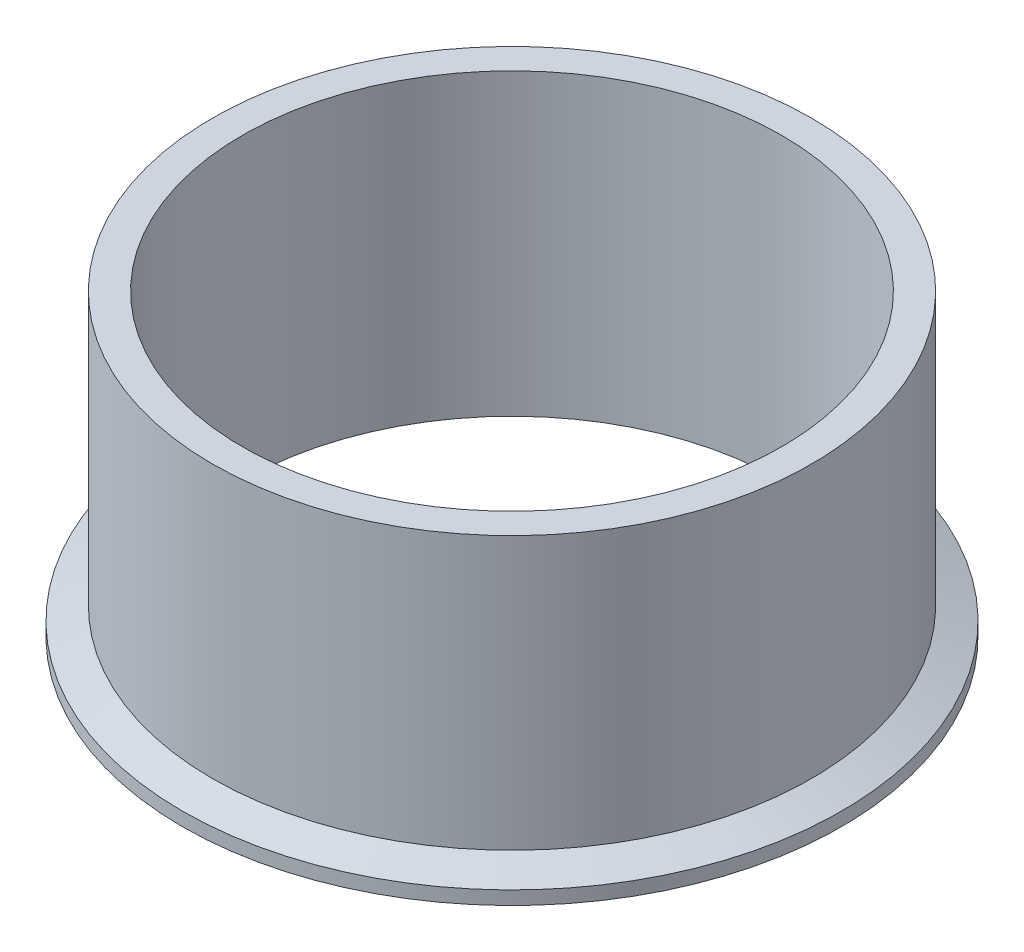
ISO-10303-21;
HEADER;
FILE_DESCRIPTION(('STEP AP214'),'2;1');
FILE_NAME('part.step','',(''),(''),'','','');
FILE_SCHEMA(('AUTOMOTIVE_DESIGN { 1 0 10303 214 1 1 1 1 }'));
ENDSEC;
DATA;
#1=APPLICATION_CONTEXT('core data for automotive mechanical design processes');
#2=APPLICATION_PROTOCOL_DEFINITION('international standard','automotive_design',2000,#1);
#3=PRODUCT_CONTEXT('',#1,'mechanical');
#4=PRODUCT('Part','Part','',(#3));
#5=PRODUCT_RELATED_PRODUCT_CATEGORY('part','',(#4));
#6=PRODUCT_DEFINITION_FORMATION('','',#4);
#7=PRODUCT_DEFINITION_CONTEXT('part definition',#1,'design');
#8=PRODUCT_DEFINITION('design','',#6,#7);
#9=PRODUCT_DEFINITION_SHAPE('','',#8);
#10=(LENGTH_UNIT() NAMED_UNIT(*) SI_UNIT(.MILLI.,.METRE.));
#11=(NAMED_UNIT(*) PLANE_ANGLE_UNIT() SI_UNIT($,.RADIAN.));
#12=(NAMED_UNIT(*) SI_UNIT($,.STERADIAN.) SOLID_ANGLE_UNIT());
#13=UNCERTAINTY_MEASURE_WITH_UNIT(LENGTH_MEASURE(1.E-05),#10,'distance_accuracy_value','');
#14=(GEOMETRIC_REPRESENTATION_CONTEXT(3) GLOBAL_UNCERTAINTY_ASSIGNED_CONTEXT((#13)) GLOBAL_UNIT_ASSIGNED_CONTEXT((#10,
#11,#12)) REPRESENTATION_CONTEXT('',''));
#15=CARTESIAN_POINT('',(0.,0.,0.));
#16=DIRECTION('',(0.,0.,1.));
#17=DIRECTION('',(1.,0.,0.));
#18=AXIS2_PLACEMENT_3D('',#15,#16,#17);
#19=CARTESIAN_POINT('',(0.,0.,0.));
#20=DIRECTION('',(0.,1.,0.));
#21=DIRECTION('',(0.,0.,1.));
#22=AXIS2_PLACEMENT_3D('',#19,#20,#21);
#23=PLANE('',#22);
#24=CARTESIAN_POINT('',(0.,0.,0.));
#25=DIRECTION('',(0.,-1.,0.));
#26=DIRECTION('',(0.,0.,-1.));
#27=AXIS2_PLACEMENT_3D('',#24,#25,#26);
#28=CIRCLE('',#27,56.7742603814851);
#29=CARTESIAN_POINT('',(0.,0.,-56.7742603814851));
#30=VERTEX_POINT('',#29);
#31=EDGE_CURVE('E10',#30,#30,#28,.T.);
#32=ORIENTED_EDGE('',*,*,#31,.F.);
#33=EDGE_LOOP('',(#32));
#34=FACE_BOUND('',#33,.T.);
#35=CARTESIAN_POINT('',(0.,0.,0.));
#36=DIRECTION('',(0.,-1.,0.));
#37=DIRECTION('',(0.,0.,-1.));
#38=AXIS2_PLACEMENT_3D('',#35,#36,#37);
#39=CIRCLE('',#38,59.4614);
#40=CARTESIAN_POINT('',(0.,0.,-59.4614));
#41=VERTEX_POINT('',#40);
#42=EDGE_CURVE('E73',#41,#41,#39,.T.);
#43=ORIENTED_EDGE('',*,*,#42,.T.);
#44=EDGE_LOOP('',(#43));
#45=FACE_BOUND('',#44,.T.);
#46=ADVANCED_FACE('F33',(#34,#45),#23,.F.);
#47=CARTESIAN_POINT('',(0.,0.762,0.));
#48=DIRECTION('',(0.,-1.,0.));
#49=DIRECTION('',(0.,0.,-1.));
#50=AXIS2_PLACEMENT_3D('',#47,#48,#49);
#51=TOROIDAL_SURFACE('',#50,56.7742603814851,0.762000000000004);
#52=CARTESIAN_POINT('',(0.,0.464262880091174,0.));
#53=DIRECTION('',(0.,-1.,0.));
#54=DIRECTION('',(0.,0.,-1.));
#55=AXIS2_PLACEMENT_3D('',#52,#53,#54);
#56=CIRCLE('',#55,56.0728356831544);
#57=CARTESIAN_POINT('',(0.,0.464262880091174,-56.0728356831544));
#58=VERTEX_POINT('',#57);
#59=EDGE_CURVE('E39',#58,#58,#56,.T.);
#60=ORIENTED_EDGE('',*,*,#59,.F.);
#61=EDGE_LOOP('',(#60));
#62=FACE_BOUND('',#61,.T.);
#63=ORIENTED_EDGE('',*,*,#31,.T.);
#64=EDGE_LOOP('',(#63));
#65=FACE_BOUND('',#64,.T.);
#66=ADVANCED_FACE('F114',(#62,#65),#51,.T.);
#67=CARTESIAN_POINT('',(0.,0.872854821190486,0.));
#68=DIRECTION('',(0.,-1.,0.));
#69=DIRECTION('',(0.,0.,-1.));
#70=AXIS2_PLACEMENT_3D('',#67,#68,#69);
#71=CONICAL_SURFACE('',#70,55.8993986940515,0.401425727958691);
#72=ORIENTED_EDGE('',*,*,#59,.T.);
#73=EDGE_LOOP('',(#72));
#74=FACE_BOUND('',#73,.T.);
#75=CARTESIAN_POINT('',(0.,0.872854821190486,0.));
#76=DIRECTION('',(0.,-1.,0.));
#77=DIRECTION('',(0.,0.,-1.));
#78=AXIS2_PLACEMENT_3D('',#75,#76,#77);
#79=CIRCLE('',#78,55.8993986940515);
#80=CARTESIAN_POINT('',(0.,0.872854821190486,-55.8993986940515));
#81=VERTEX_POINT('',#80);
#82=EDGE_CURVE('E43',#81,#81,#79,.T.);
#83=ORIENTED_EDGE('',*,*,#82,.F.);
#84=EDGE_LOOP('',(#83));
#85=FACE_BOUND('',#84,.T.);
#86=ADVANCED_FACE('F119',(#74,#85),#71,.F.);
#87=CARTESIAN_POINT('',(0.,0.4064,0.));
#88=DIRECTION('',(0.,-1.,0.));
#89=DIRECTION('',(0.,0.,-1.));
#90=AXIS2_PLACEMENT_3D('',#87,#88,#89);
#91=TOROIDAL_SURFACE('',#90,54.8005,1.1938);
#92=ORIENTED_EDGE('',*,*,#82,.T.);
#93=EDGE_LOOP('',(#92));
#94=FACE_BOUND('',#93,.T.);
#95=CARTESIAN_POINT('',(0.,0.872854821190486,0.));
#96=DIRECTION('',(0.,-1.,0.));
#97=DIRECTION('',(0.,0.,-1.));
#98=AXIS2_PLACEMENT_3D('',#95,#96,#97);
#99=CIRCLE('',#98,53.7016013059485);
#100=CARTESIAN_POINT('',(0.,0.872854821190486,-53.7016013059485));
#101=VERTEX_POINT('',#100);
#102=EDGE_CURVE('E47',#101,#101,#99,.T.);
#103=ORIENTED_EDGE('',*,*,#102,.F.);
#104=EDGE_LOOP('',(#103));
#105=FACE_BOUND('',#104,.T.);
#106=ADVANCED_FACE('F124',(#94,#105),#91,.F.);
#107=CARTESIAN_POINT('',(0.,0.872854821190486,0.));
#108=DIRECTION('',(0.,1.,0.));
#109=DIRECTION('',(0.,0.,1.));
#110=AXIS2_PLACEMENT_3D('',#107,#108,#109);
#111=CONICAL_SURFACE('',#110,53.7016013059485,0.401425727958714);
#112=CARTESIAN_POINT('',(0.,0.464262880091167,0.));
#113=DIRECTION('',(0.,-1.,0.));
#114=DIRECTION('',(0.,0.,-1.));
#115=AXIS2_PLACEMENT_3D('',#112,#113,#114);
#116=CIRCLE('',#115,53.5281643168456);
#117=CARTESIAN_POINT('',(0.,0.464262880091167,-53.5281643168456));
#118=VERTEX_POINT('',#117);
#119=EDGE_CURVE('E52',#118,#118,#116,.T.);
#120=ORIENTED_EDGE('',*,*,#119,.F.);
#121=EDGE_LOOP('',(#120));
#122=FACE_BOUND('',#121,.T.);
#123=ORIENTED_EDGE('',*,*,#102,.T.);
#124=EDGE_LOOP('',(#123));
#125=FACE_BOUND('',#124,.T.);
#126=ADVANCED_FACE('F129',(#122,#125),#111,.T.);
#127=CARTESIAN_POINT('',(0.,0.762,0.));
#128=DIRECTION('',(0.,-1.,0.));
#129=DIRECTION('',(0.,0.,-1.));
#130=AXIS2_PLACEMENT_3D('',#127,#128,#129);
#131=TOROIDAL_SURFACE('',#130,52.8267396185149,0.762000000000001);
#132=ORIENTED_EDGE('',*,*,#119,.T.);
#133=EDGE_LOOP('',(#132));
#134=FACE_BOUND('',#133,.T.);
#135=CARTESIAN_POINT('',(0.,0.,0.));
#136=DIRECTION('',(0.,-1.,0.));
#137=DIRECTION('',(0.,0.,-1.));
#138=AXIS2_PLACEMENT_3D('',#135,#136,#137);
#139=CIRCLE('',#138,52.8267396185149);
#140=CARTESIAN_POINT('',(0.,0.,-52.8267396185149));
#141=VERTEX_POINT('',#140);
#142=EDGE_CURVE('E55',#141,#141,#139,.T.);
#143=ORIENTED_EDGE('',*,*,#142,.F.);
#144=EDGE_LOOP('',(#143));
#145=FACE_BOUND('',#144,.T.);
#146=ADVANCED_FACE('F110',(#134,#145),#131,.T.);
#147=CARTESIAN_POINT('',(0.,0.,0.));
#148=DIRECTION('',(0.,1.,0.));
#149=DIRECTION('',(0.,0.,1.));
#150=AXIS2_PLACEMENT_3D('',#147,#148,#149);
#151=PLANE('',#150);
#152=CARTESIAN_POINT('',(0.,0.,0.));
#153=DIRECTION('',(0.,-1.,0.));
#154=DIRECTION('',(0.,0.,-1.));
#155=AXIS2_PLACEMENT_3D('',#152,#153,#154);
#156=CIRCLE('',#155,48.6664);
#157=CARTESIAN_POINT('',(0.,0.,-48.6664));
#158=VERTEX_POINT('',#157);
#159=EDGE_CURVE('E58',#158,#158,#156,.T.);
#160=ORIENTED_EDGE('',*,*,#159,.F.);
#161=EDGE_LOOP('',(#160));
#162=FACE_BOUND('',#161,.T.);
#163=ORIENTED_EDGE('',*,*,#142,.T.);
#164=EDGE_LOOP('',(#163));
#165=FACE_BOUND('',#164,.T.);
#166=ADVANCED_FACE('F104',(#162,#165),#151,.F.);
#167=CARTESIAN_POINT('',(0.,0.,0.));
#168=DIRECTION('',(0.,-1.,0.));
#169=DIRECTION('',(0.,0.,-1.));
#170=AXIS2_PLACEMENT_3D('',#167,#168,#169);
#171=CYLINDRICAL_SURFACE('',#170,48.6664);
#172=ORIENTED_EDGE('',*,*,#159,.T.);
#173=EDGE_LOOP('',(#172));
#174=FACE_BOUND('',#173,.T.);
#175=CARTESIAN_POINT('',(0.,53.975,0.));
#176=DIRECTION('',(0.,-1.,0.));
#177=DIRECTION('',(0.,0.,-1.));
#178=AXIS2_PLACEMENT_3D('',#175,#176,#177);
#179=CIRCLE('',#178,48.6664);
#180=CARTESIAN_POINT('',(0.,53.975,-48.6664));
#181=VERTEX_POINT('',#180);
#182=EDGE_CURVE('E61',#181,#181,#179,.T.);
#183=ORIENTED_EDGE('',*,*,#182,.F.);
#184=EDGE_LOOP('',(#183));
#185=FACE_BOUND('',#184,.T.);
#186=ADVANCED_FACE('F99',(#174,#185),#171,.F.);
#187=CARTESIAN_POINT('',(0.,53.975,0.));
#188=DIRECTION('',(0.,-1.,0.));
#189=DIRECTION('',(0.,0.,-1.));
#190=AXIS2_PLACEMENT_3D('',#187,#188,#189);
#191=PLANE('',#190);
#192=CARTESIAN_POINT('',(0.,53.975,0.));
#193=DIRECTION('',(0.,-1.,0.));
#194=DIRECTION('',(0.,0.,-1.));
#195=AXIS2_PLACEMENT_3D('',#192,#193,#194);
#196=CIRCLE('',#195,54.0512);
#197=CARTESIAN_POINT('',(0.,53.975,-54.0512));
#198=VERTEX_POINT('',#197);
#199=EDGE_CURVE('E64',#198,#198,#196,.T.);
#200=ORIENTED_EDGE('',*,*,#199,.F.);
#201=EDGE_LOOP('',(#200));
#202=FACE_BOUND('',#201,.T.);
#203=ORIENTED_EDGE('',*,*,#182,.T.);
#204=EDGE_LOOP('',(#203));
#205=FACE_BOUND('',#204,.T.);
#206=ADVANCED_FACE('F93',(#202,#205),#191,.F.);
#207=CARTESIAN_POINT('',(0.,0.,0.));
#208=DIRECTION('',(0.,-1.,0.));
#209=DIRECTION('',(0.,0.,-1.));
#210=AXIS2_PLACEMENT_3D('',#207,#208,#209);
#211=CYLINDRICAL_SURFACE('',#210,54.0512);
#212=CARTESIAN_POINT('',(0.,4.813951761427,0.));
#213=DIRECTION('',(0.,-1.,0.));
#214=DIRECTION('',(0.,0.,-1.));
#215=AXIS2_PLACEMENT_3D('',#212,#213,#214);
#216=CIRCLE('',#215,54.0512);
#217=CARTESIAN_POINT('',(0.,4.813951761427,-54.0512));
#218=VERTEX_POINT('',#217);
#219=EDGE_CURVE('E67',#218,#218,#216,.T.);
#220=ORIENTED_EDGE('',*,*,#219,.F.);
#221=EDGE_LOOP('',(#220));
#222=FACE_BOUND('',#221,.T.);
#223=ORIENTED_EDGE('',*,*,#199,.T.);
#224=EDGE_LOOP('',(#223));
#225=FACE_BOUND('',#224,.T.);
#226=ADVANCED_FACE('F87',(#222,#225),#211,.T.);
#227=CARTESIAN_POINT('',(0.,4.813951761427,0.));
#228=DIRECTION('',(0.,-1.,0.));
#229=DIRECTION('',(0.,0.,-1.));
#230=AXIS2_PLACEMENT_3D('',#227,#228,#229);
#231=CONICAL_SURFACE('',#230,54.0512,1.15705411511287);
#232=CARTESIAN_POINT('',(0.,2.43839999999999,0.));
#233=DIRECTION('',(0.,-1.,0.));
#234=DIRECTION('',(0.,0.,-1.));
#235=AXIS2_PLACEMENT_3D('',#232,#233,#234);
#236=CIRCLE('',#235,59.4614);
#237=CARTESIAN_POINT('',(0.,2.43839999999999,-59.4614));
#238=VERTEX_POINT('',#237);
#239=EDGE_CURVE('E70',#238,#238,#236,.T.);
#240=ORIENTED_EDGE('',*,*,#239,.F.);
#241=EDGE_LOOP('',(#240));
#242=FACE_BOUND('',#241,.T.);
#243=ORIENTED_EDGE('',*,*,#219,.T.);
#244=EDGE_LOOP('',(#243));
#245=FACE_BOUND('',#244,.T.);
#246=ADVANCED_FACE('F81',(#242,#245),#231,.T.);
#247=CARTESIAN_POINT('',(0.,0.,0.));
#248=DIRECTION('',(0.,-1.,0.));
#249=DIRECTION('',(0.,0.,-1.));
#250=AXIS2_PLACEMENT_3D('',#247,#248,#249);
#251=CYLINDRICAL_SURFACE('',#250,59.4614);
#252=ORIENTED_EDGE('',*,*,#42,.F.);
#253=EDGE_LOOP('',(#252));
#254=FACE_BOUND('',#253,.T.);
#255=ORIENTED_EDGE('',*,*,#239,.T.);
#256=EDGE_LOOP('',(#255));
#257=FACE_BOUND('',#256,.T.);
#258=ADVANCED_FACE('F78',(#254,#257),#251,.T.);
#259=CLOSED_SHELL('',(#46,#66,#86,#106,#126,#146,#166,#186,#206,#226,#246,#258));
#260=MANIFOLD_SOLID_BREP('B2',#259);
#261=ADVANCED_BREP_SHAPE_REPRESENTATION('',(#18,#260),#14);
#262=SHAPE_DEFINITION_REPRESENTATION(#9,#261);
ENDSEC;
END-ISO-10303-21;
